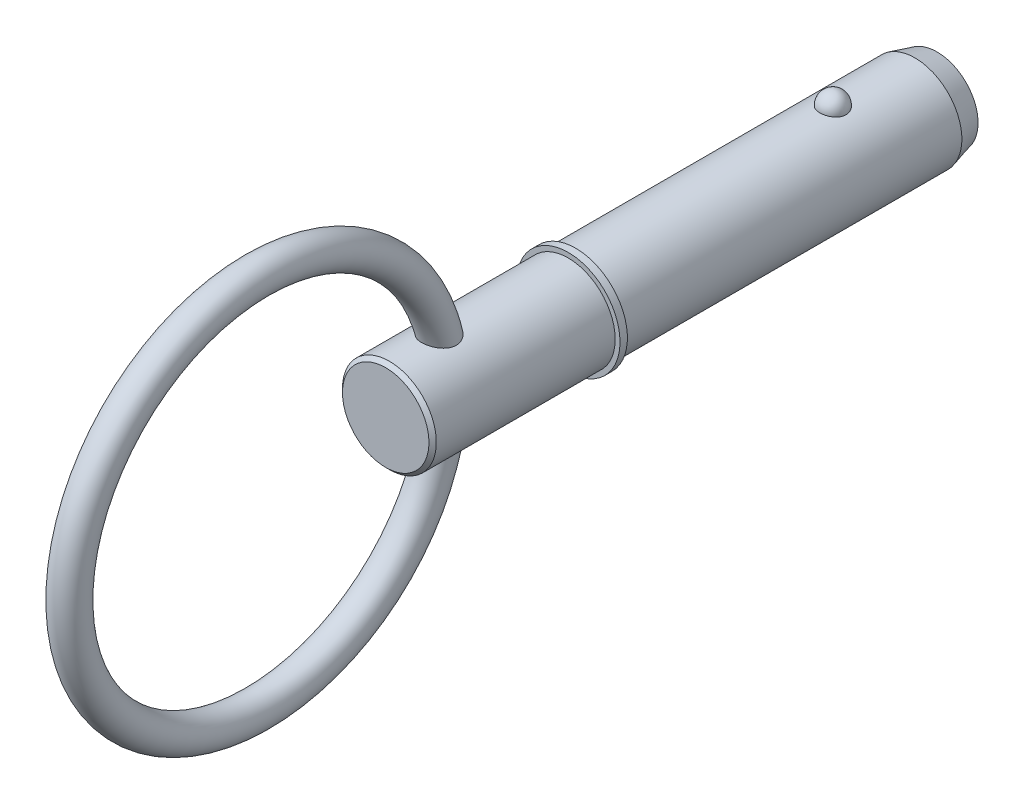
ISO-10303-21;
HEADER;
FILE_DESCRIPTION(('STEP AP214'),'2;1');
FILE_NAME('part.step','',(''),(''),'','','');
FILE_SCHEMA(('AUTOMOTIVE_DESIGN { 1 0 10303 214 1 1 1 1 }'));
ENDSEC;
DATA;
#1=APPLICATION_CONTEXT('core data for automotive mechanical design processes');
#2=APPLICATION_PROTOCOL_DEFINITION('international standard','automotive_design',2000,#1);
#3=PRODUCT_CONTEXT('',#1,'mechanical');
#4=PRODUCT('Part','Part','',(#3));
#5=PRODUCT_RELATED_PRODUCT_CATEGORY('part','',(#4));
#6=PRODUCT_DEFINITION_FORMATION('','',#4);
#7=PRODUCT_DEFINITION_CONTEXT('part definition',#1,'design');
#8=PRODUCT_DEFINITION('design','',#6,#7);
#9=PRODUCT_DEFINITION_SHAPE('','',#8);
#10=(LENGTH_UNIT() NAMED_UNIT(*) SI_UNIT(.MILLI.,.METRE.));
#11=(NAMED_UNIT(*) PLANE_ANGLE_UNIT() SI_UNIT($,.RADIAN.));
#12=(NAMED_UNIT(*) SI_UNIT($,.STERADIAN.) SOLID_ANGLE_UNIT());
#13=UNCERTAINTY_MEASURE_WITH_UNIT(LENGTH_MEASURE(1.E-05),#10,'distance_accuracy_value','');
#14=(GEOMETRIC_REPRESENTATION_CONTEXT(3) GLOBAL_UNCERTAINTY_ASSIGNED_CONTEXT((#13)) GLOBAL_UNIT_ASSIGNED_CONTEXT((#10,
#11,#12)) REPRESENTATION_CONTEXT('',''));
#15=CARTESIAN_POINT('',(0.,0.,0.));
#16=DIRECTION('',(0.,0.,1.));
#17=DIRECTION('',(1.,0.,0.));
#18=AXIS2_PLACEMENT_3D('',#15,#16,#17);
#19=CARTESIAN_POINT('',(0.,0.,33.02));
#20=DIRECTION('',(0.,0.,-1.));
#21=DIRECTION('',(-1.,0.,0.));
#22=AXIS2_PLACEMENT_3D('',#19,#20,#21);
#23=CYLINDRICAL_SURFACE('',#22,6.35);
#24=CARTESIAN_POINT('',(1.76243001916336,6.10051968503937,-1.78));
#25=CARTESIAN_POINT('',(1.76242835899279,6.10052111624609,-1.68050311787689));
#26=CARTESIAN_POINT('',(1.75431593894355,6.1028816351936,-1.58098521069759));
#27=CARTESIAN_POINT('',(1.72206027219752,6.11206037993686,-1.38476972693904));
#28=CARTESIAN_POINT('',(1.69791106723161,6.11888026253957,-1.28807321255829));
#29=CARTESIAN_POINT('',(1.63419596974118,6.13620287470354,-1.10029899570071));
#30=CARTESIAN_POINT('',(1.59463684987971,6.14670398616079,-1.00921884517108));
#31=CARTESIAN_POINT('',(1.50108569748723,6.17021534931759,-0.835161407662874));
#32=CARTESIAN_POINT('',(1.44709398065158,6.18322554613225,-0.752183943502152));
#33=CARTESIAN_POINT('',(1.3257243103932,6.21038081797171,-0.596209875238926));
#34=CARTESIAN_POINT('',(1.2582815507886,6.22453118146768,-0.523264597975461));
#35=CARTESIAN_POINT('',(1.11191624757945,6.25233390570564,-0.389855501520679));
#36=CARTESIAN_POINT('',(1.03299369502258,6.26598626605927,-0.329391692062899));
#37=CARTESIAN_POINT('',(0.866022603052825,6.29123226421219,-0.222793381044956));
#38=CARTESIAN_POINT('',(0.778000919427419,6.30283170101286,-0.176618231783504));
#39=CARTESIAN_POINT('',(0.59510847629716,6.32272058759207,-0.0996905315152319));
#40=CARTESIAN_POINT('',(0.500238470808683,6.33101040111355,-0.0689362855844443));
#41=CARTESIAN_POINT('',(0.308164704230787,6.34323464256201,-0.0241595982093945));
#42=CARTESIAN_POINT('',(0.211033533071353,6.34724467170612,-0.00984637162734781));
#43=CARTESIAN_POINT('',(0.0156629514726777,6.3507318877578,0.00262058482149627));
#44=CARTESIAN_POINT('',(-0.0825763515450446,6.35020951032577,0.000775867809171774));
#45=CARTESIAN_POINT('',(-0.275890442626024,6.34473055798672,-0.018872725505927));
#46=CARTESIAN_POINT('',(-0.370990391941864,6.3398374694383,-0.0364481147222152));
#47=CARTESIAN_POINT('',(-0.556805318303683,6.32622723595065,-0.0867447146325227));
#48=CARTESIAN_POINT('',(-0.647520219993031,6.31751002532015,-0.119466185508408));
#49=CARTESIAN_POINT('',(-0.822606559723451,6.29711353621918,-0.199386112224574));
#50=CARTESIAN_POINT('',(-0.906938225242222,6.28541739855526,-0.246667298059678));
#51=CARTESIAN_POINT('',(-1.06646479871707,6.26032612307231,-0.354365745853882));
#52=CARTESIAN_POINT('',(-1.14165877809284,6.24693081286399,-0.414784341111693));
#53=CARTESIAN_POINT('',(-1.2823514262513,6.21959142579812,-0.548435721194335));
#54=CARTESIAN_POINT('',(-1.34763761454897,6.2056417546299,-0.621891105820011));
#55=CARTESIAN_POINT('',(-1.4651153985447,6.17896241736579,-0.778815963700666));
#56=CARTESIAN_POINT('',(-1.51730606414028,6.16623283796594,-0.862286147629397));
#57=CARTESIAN_POINT('',(-1.60782211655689,6.14325839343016,-1.0379915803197));
#58=CARTESIAN_POINT('',(-1.64598111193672,6.13304379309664,-1.13031660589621));
#59=CARTESIAN_POINT('',(-1.70661885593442,6.11644899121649,-1.32030667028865));
#60=CARTESIAN_POINT('',(-1.72909805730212,6.11006867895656,-1.41797155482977));
#61=CARTESIAN_POINT('',(-1.75775019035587,6.1018881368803,-1.61543246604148));
#62=CARTESIAN_POINT('',(-1.76399136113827,6.10006874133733,-1.71521779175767));
#63=CARTESIAN_POINT('',(-1.76020715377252,6.10116172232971,-1.91445126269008));
#64=CARTESIAN_POINT('',(-1.75018221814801,6.10407397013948,-2.01389941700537));
#65=CARTESIAN_POINT('',(-1.71421005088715,6.11427232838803,-2.20912106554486));
#66=CARTESIAN_POINT('',(-1.68834262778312,6.12153651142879,-2.30491043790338));
#67=CARTESIAN_POINT('',(-1.62139543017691,6.1396067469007,-2.49066180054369));
#68=CARTESIAN_POINT('',(-1.5803150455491,6.15041294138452,-2.58062355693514));
#69=CARTESIAN_POINT('',(-1.48369112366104,6.17443456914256,-2.75271428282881));
#70=CARTESIAN_POINT('',(-1.42806998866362,6.18766281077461,-2.83479789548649));
#71=CARTESIAN_POINT('',(-1.30386620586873,6.21501934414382,-2.98832532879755));
#72=CARTESIAN_POINT('',(-1.23528306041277,6.22914767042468,-3.05976874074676));
#73=CARTESIAN_POINT('',(-1.08663999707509,6.25679135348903,-3.19029656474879));
#74=CARTESIAN_POINT('',(-1.00653826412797,6.27030422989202,-3.24933392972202));
#75=CARTESIAN_POINT('',(-0.837212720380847,6.29514770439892,-3.35304657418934));
#76=CARTESIAN_POINT('',(-0.747989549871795,6.30647845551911,-3.39772286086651));
#77=CARTESIAN_POINT('',(-0.564098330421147,6.32556124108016,-3.47096393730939));
#78=CARTESIAN_POINT('',(-0.469512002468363,6.33335611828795,-3.49972259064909));
#79=CARTESIAN_POINT('',(-0.27663389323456,6.34470628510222,-3.54113722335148));
#80=CARTESIAN_POINT('',(-0.17834256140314,6.34826208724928,-3.55379514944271));
#81=CARTESIAN_POINT('',(0.0171660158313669,6.35071525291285,-3.56255473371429));
#82=CARTESIAN_POINT('',(0.114368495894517,6.34969931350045,-3.55896450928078));
#83=CARTESIAN_POINT('',(0.306746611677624,6.34331695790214,-3.53603383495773));
#84=CARTESIAN_POINT('',(0.401922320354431,6.33795069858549,-3.51669395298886));
#85=CARTESIAN_POINT('',(0.587203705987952,6.32347219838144,-3.4629173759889));
#86=CARTESIAN_POINT('',(0.677327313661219,6.31437430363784,-3.42853846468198));
#87=CARTESIAN_POINT('',(0.850462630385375,6.29339543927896,-3.34564128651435));
#88=CARTESIAN_POINT('',(0.933473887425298,6.2815142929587,-3.29712212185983));
#89=CARTESIAN_POINT('',(1.09144542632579,6.25601750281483,-3.18638742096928));
#90=CARTESIAN_POINT('',(1.16626195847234,6.24237795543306,-3.12397237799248));
#91=CARTESIAN_POINT('',(1.304448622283,6.21497285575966,-2.98755865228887));
#92=CARTESIAN_POINT('',(1.36781676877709,6.20120728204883,-2.91355796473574));
#93=CARTESIAN_POINT('',(1.48252779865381,6.17479923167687,-2.75456133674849));
#94=CARTESIAN_POINT('',(1.53364167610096,6.16218052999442,-2.66939613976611));
#95=CARTESIAN_POINT('',(1.62109397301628,6.13975602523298,-2.49147502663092));
#96=CARTESIAN_POINT('',(1.657437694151,6.12994921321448,-2.39872184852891));
#97=CARTESIAN_POINT('',(1.71127844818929,6.11512175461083,-2.21887622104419));
#98=CARTESIAN_POINT('',(1.73042646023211,6.10968903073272,-2.13230770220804));
#99=CARTESIAN_POINT('',(1.75600284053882,6.10238739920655,-1.95716498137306));
#100=CARTESIAN_POINT('',(1.76243149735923,6.10051841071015,-1.86859082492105));
#101=CARTESIAN_POINT('',(1.76243001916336,6.10051968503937,-1.78));
#102=B_SPLINE_CURVE_WITH_KNOTS('',3,(#24,#25,#26,#27,#28,#29,#30,#31,#32,#33,#34,#35,#36,#37,
#38,#39,#40,#41,#42,#43,#44,#45,#46,#47,#48,#49,#50,#51,#52,#53,#54,#55,#56,#57,#58,#59,#60,#61,
#62,#63,#64,#65,#66,#67,#68,#69,#70,#71,#72,#73,#74,#75,#76,#77,#78,#79,#80,#81,#82,#83,#84,#85,
#86,#87,#88,#89,#90,#91,#92,#93,#94,#95,#96,#97,#98,#99,#100,#101),.UNSPECIFIED.,.T.,.F.,(4,2,2,
2,2,2,2,2,2,2,2,2,2,2,2,2,2,2,2,2,2,2,2,2,2,2,2,2,2,2,2,2,2,2,2,2,2,2,4),(0.,0.298172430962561,
0.596455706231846,0.894608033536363,1.19275383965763,1.49237238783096,1.79199116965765,
2.09074960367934,2.38947519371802,2.68283180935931,2.97616022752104,3.26529599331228,
3.5544367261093,3.84525169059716,4.13609618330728,4.43249276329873,4.72891038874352,
5.02873757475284,5.32855610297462,5.62711261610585,5.92566100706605,6.22271765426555,
6.519786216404,6.81847366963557,7.11717259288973,7.41698459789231,7.71677557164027,
8.01283014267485,8.30884891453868,8.59927798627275,8.88969658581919,9.17900899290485,
9.46833977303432,9.76212836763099,10.0559678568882,10.3549321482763,10.6537890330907,
10.9192841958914,11.1847733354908),.UNSPECIFIED.);
#103=CARTESIAN_POINT('',(1.76243001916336,6.10051968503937,-1.78));
#104=VERTEX_POINT('',#103);
#105=EDGE_CURVE('E103',#104,#104,#102,.T.);
#106=ORIENTED_EDGE('',*,*,#105,.T.);
#107=EDGE_LOOP('',(#106));
#108=FACE_BOUND('',#107,.T.);
#109=CARTESIAN_POINT('',(0.,0.,-12.88));
#110=DIRECTION('',(0.,0.,-1.));
#111=DIRECTION('',(-1.,0.,0.));
#112=AXIS2_PLACEMENT_3D('',#109,#110,#111);
#113=CIRCLE('',#112,6.35);
#114=CARTESIAN_POINT('',(-6.35,0.,-12.88));
#115=VERTEX_POINT('',#114);
#116=EDGE_CURVE('E110',#115,#115,#113,.F.);
#117=ORIENTED_EDGE('',*,*,#116,.T.);
#118=EDGE_LOOP('',(#117));
#119=FACE_BOUND('',#118,.T.);
#120=CARTESIAN_POINT('',(0.,0.,33.02));
#121=DIRECTION('',(0.,0.,1.));
#122=DIRECTION('',(1.,0.,0.));
#123=AXIS2_PLACEMENT_3D('',#120,#121,#122);
#124=CIRCLE('',#123,6.35);
#125=CARTESIAN_POINT('',(6.35,0.,33.02));
#126=VERTEX_POINT('',#125);
#127=EDGE_CURVE('E108',#126,#126,#124,.T.);
#128=ORIENTED_EDGE('',*,*,#127,.F.);
#129=EDGE_LOOP('',(#128));
#130=FACE_BOUND('',#129,.T.);
#131=ADVANCED_FACE('F39',(#108,#119,#130),#23,.T.);
#132=CARTESIAN_POINT('',(0.,0.,-15.88));
#133=DIRECTION('',(0.,0.,-1.));
#134=DIRECTION('',(-1.,0.,0.));
#135=AXIS2_PLACEMENT_3D('',#132,#133,#134);
#136=PLANE('',#135);
#137=CARTESIAN_POINT('',(0.,0.,-15.88));
#138=DIRECTION('',(0.,0.,-1.));
#139=DIRECTION('',(-1.,0.,0.));
#140=AXIS2_PLACEMENT_3D('',#137,#138,#139);
#141=CIRCLE('',#140,5.54615242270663);
#142=CARTESIAN_POINT('',(-5.54615242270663,0.,-15.88));
#143=VERTEX_POINT('',#142);
#144=EDGE_CURVE('E140',#143,#143,#141,.T.);
#145=ORIENTED_EDGE('',*,*,#144,.T.);
#146=EDGE_LOOP('',(#145));
#147=FACE_BOUND('',#146,.T.);
#148=ADVANCED_FACE('F89',(#147),#136,.T.);
#149=CARTESIAN_POINT('',(0.,0.,-15.88));
#150=DIRECTION('',(0.,0.,1.));
#151=DIRECTION('',(1.,0.,0.));
#152=AXIS2_PLACEMENT_3D('',#149,#150,#151);
#153=CONICAL_SURFACE('',#152,5.54615242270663,0.261799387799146);
#154=ORIENTED_EDGE('',*,*,#116,.F.);
#155=EDGE_LOOP('',(#154));
#156=FACE_BOUND('',#155,.T.);
#157=ORIENTED_EDGE('',*,*,#144,.F.);
#158=EDGE_LOOP('',(#157));
#159=FACE_BOUND('',#158,.T.);
#160=ADVANCED_FACE('F95',(#156,#159),#153,.T.);
#161=CARTESIAN_POINT('',(0.,6.35,-1.78));
#162=DIRECTION('',(0.,1.,0.));
#163=DIRECTION('',(0.,0.,1.));
#164=AXIS2_PLACEMENT_3D('',#161,#162,#163);
#165=SPHERICAL_SURFACE('',#164,1.78);
#166=ORIENTED_EDGE('',*,*,#105,.F.);
#167=EDGE_LOOP('',(#166));
#168=FACE_BOUND('',#167,.T.);
#169=ADVANCED_FACE('F113',(#168),#165,.T.);
#170=CARTESIAN_POINT('',(0.,0.,33.02));
#171=DIRECTION('',(0.,0.,-1.));
#172=DIRECTION('',(-1.,0.,0.));
#173=AXIS2_PLACEMENT_3D('',#170,#171,#172);
#174=PLANE('',#173);
#175=ORIENTED_EDGE('',*,*,#127,.T.);
#176=EDGE_LOOP('',(#175));
#177=FACE_BOUND('',#176,.T.);
#178=CARTESIAN_POINT('',(0.,0.,33.02));
#179=DIRECTION('',(0.,0.,-1.));
#180=DIRECTION('',(-1.,0.,0.));
#181=AXIS2_PLACEMENT_3D('',#178,#179,#180);
#182=CIRCLE('',#181,7.);
#183=CARTESIAN_POINT('',(-7.,0.,33.02));
#184=VERTEX_POINT('',#183);
#185=EDGE_CURVE('E109',#184,#184,#182,.T.);
#186=ORIENTED_EDGE('',*,*,#185,.T.);
#187=EDGE_LOOP('',(#186));
#188=FACE_BOUND('',#187,.T.);
#189=ADVANCED_FACE('F117',(#177,#188),#174,.T.);
#190=CARTESIAN_POINT('',(0.,0.,33.7287874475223));
#191=DIRECTION('',(0.,0.,-1.));
#192=DIRECTION('',(-1.,0.,0.));
#193=AXIS2_PLACEMENT_3D('',#190,#191,#192);
#194=CYLINDRICAL_SURFACE('',#193,7.);
#195=CARTESIAN_POINT('',(0.,0.,34.02));
#196=DIRECTION('',(0.,0.,-1.));
#197=DIRECTION('',(-1.,0.,0.));
#198=AXIS2_PLACEMENT_3D('',#195,#196,#197);
#199=CIRCLE('',#198,7.);
#200=CARTESIAN_POINT('',(-7.,0.,34.02));
#201=VERTEX_POINT('',#200);
#202=EDGE_CURVE('E134',#201,#201,#199,.T.);
#203=ORIENTED_EDGE('',*,*,#202,.T.);
#204=EDGE_LOOP('',(#203));
#205=FACE_BOUND('',#204,.T.);
#206=ORIENTED_EDGE('',*,*,#185,.F.);
#207=EDGE_LOOP('',(#206));
#208=FACE_BOUND('',#207,.T.);
#209=ADVANCED_FACE('F121',(#205,#208),#194,.T.);
#210=CARTESIAN_POINT('',(0.,7.,34.02));
#211=DIRECTION('',(0.,0.,1.));
#212=DIRECTION('',(1.,0.,0.));
#213=AXIS2_PLACEMENT_3D('',#210,#211,#212);
#214=PLANE('',#213);
#215=CARTESIAN_POINT('',(0.,0.,34.02));
#216=DIRECTION('',(0.,0.,1.));
#217=DIRECTION('',(1.,0.,0.));
#218=AXIS2_PLACEMENT_3D('',#215,#216,#217);
#219=CIRCLE('',#218,6.35);
#220=CARTESIAN_POINT('',(6.35,0.,34.02));
#221=VERTEX_POINT('',#220);
#222=EDGE_CURVE('E112',#221,#221,#219,.T.);
#223=ORIENTED_EDGE('',*,*,#222,.F.);
#224=EDGE_LOOP('',(#223));
#225=FACE_BOUND('',#224,.T.);
#226=ORIENTED_EDGE('',*,*,#202,.F.);
#227=EDGE_LOOP('',(#226));
#228=FACE_BOUND('',#227,.T.);
#229=ADVANCED_FACE('F86',(#225,#228),#214,.T.);
#230=CARTESIAN_POINT('',(0.,0.,58.72));
#231=DIRECTION('',(0.,0.,-1.));
#232=DIRECTION('',(-1.,0.,0.));
#233=AXIS2_PLACEMENT_3D('',#230,#231,#232);
#234=CYLINDRICAL_SURFACE('',#233,6.35);
#235=CARTESIAN_POINT('',(-1.08120660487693,-6.25727514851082,49.4715811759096));
#236=CARTESIAN_POINT('',(-0.970724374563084,-6.27636409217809,49.4138798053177));
#237=CARTESIAN_POINT('',(-0.855136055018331,-6.29329984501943,49.3652195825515));
#238=CARTESIAN_POINT('',(-0.6169586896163,-6.32109419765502,49.2870559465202));
#239=CARTESIAN_POINT('',(-0.494369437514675,-6.3319526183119,49.2575530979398));
#240=CARTESIAN_POINT('',(-0.245606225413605,-6.34647141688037,49.2183673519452));
#241=CARTESIAN_POINT('',(-0.119431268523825,-6.35012977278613,49.2086900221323));
#242=CARTESIAN_POINT('',(0.132849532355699,-6.34986313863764,49.2094002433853));
#243=CARTESIAN_POINT('',(0.258955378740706,-6.34593843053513,49.2197870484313));
#244=CARTESIAN_POINT('',(0.506912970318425,-6.33094785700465,49.2602854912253));
#245=CARTESIAN_POINT('',(0.628781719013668,-6.31991516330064,49.2903055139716));
#246=CARTESIAN_POINT('',(0.865486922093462,-6.29187143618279,49.3693088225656));
#247=CARTESIAN_POINT('',(0.98032275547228,-6.27485987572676,49.418293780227));
#248=CARTESIAN_POINT('',(1.20050616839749,-6.23649440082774,49.5345408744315));
#249=CARTESIAN_POINT('',(1.30578867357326,-6.21511352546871,49.6019174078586));
#250=CARTESIAN_POINT('',(1.50311440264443,-6.17036440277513,49.7533596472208));
#251=CARTESIAN_POINT('',(1.59515714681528,-6.14699608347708,49.8374259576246));
#252=CARTESIAN_POINT('',(1.76326863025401,-6.10090072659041,50.0202474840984));
#253=CARTESIAN_POINT('',(1.83935482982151,-6.07817301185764,50.1189864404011));
#254=CARTESIAN_POINT('',(1.97338559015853,-6.03599268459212,50.328703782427));
#255=CARTESIAN_POINT('',(2.03133638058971,-6.01653894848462,50.4396779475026));
#256=CARTESIAN_POINT('',(2.1259120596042,-5.98376466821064,50.667018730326));
#257=CARTESIAN_POINT('',(2.16315310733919,-5.97026970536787,50.7831040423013));
#258=CARTESIAN_POINT('',(2.21830650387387,-5.94999923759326,51.0203187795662));
#259=CARTESIAN_POINT('',(2.2362211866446,-5.94322292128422,51.1414475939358));
#260=CARTESIAN_POINT('',(2.25273772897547,-5.93698111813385,51.3832812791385));
#261=CARTESIAN_POINT('',(2.25163224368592,-5.93740484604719,51.5039640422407));
#262=CARTESIAN_POINT('',(2.23167546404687,-5.94493297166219,51.7436203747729));
#263=CARTESIAN_POINT('',(2.21281883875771,-5.9520393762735,51.8625934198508));
#264=CARTESIAN_POINT('',(2.15679576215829,-5.97257680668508,52.103836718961));
#265=CARTESIAN_POINT('',(2.11851138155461,-5.98639144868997,52.2258128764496));
#266=CARTESIAN_POINT('',(2.02470263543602,-6.01876484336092,52.4622848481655));
#267=CARTESIAN_POINT('',(1.96916879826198,-6.03732620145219,52.5767765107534));
#268=CARTESIAN_POINT('',(1.8352662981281,-6.07945247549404,52.8079958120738));
#269=CARTESIAN_POINT('',(1.75507038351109,-6.10334207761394,52.9236110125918));
#270=CARTESIAN_POINT('',(1.57657889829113,-6.1518655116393,53.1398949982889));
#271=CARTESIAN_POINT('',(1.47827192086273,-6.17649980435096,53.2405542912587));
#272=CARTESIAN_POINT('',(1.26306696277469,-6.22410762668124,53.4250235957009));
#273=CARTESIAN_POINT('',(1.14585214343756,-6.24704086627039,53.5084783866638));
#274=CARTESIAN_POINT('',(0.896825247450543,-6.28760987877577,53.651400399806));
#275=CARTESIAN_POINT('',(0.765036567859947,-6.30525397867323,53.7109053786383));
#276=CARTESIAN_POINT('',(0.509454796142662,-6.330648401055,53.7952631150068));
#277=CARTESIAN_POINT('',(0.386964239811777,-6.33940909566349,53.8236959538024));
#278=CARTESIAN_POINT('',(0.200813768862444,-6.3471308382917,53.8486800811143));
#279=CARTESIAN_POINT('',(0.138353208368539,-6.34880140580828,53.854063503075));
#280=CARTESIAN_POINT('',(0.0131841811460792,-6.35029448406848,53.8588738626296));
#281=CARTESIAN_POINT('',(-0.0495242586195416,-6.35011719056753,53.8583014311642));
#282=CARTESIAN_POINT('',(-0.219860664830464,-6.34710452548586,53.8485979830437));
#283=CARTESIAN_POINT('',(-0.327176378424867,-6.34243953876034,53.8335767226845));
#284=CARTESIAN_POINT('',(-0.537619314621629,-6.32808248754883,53.786673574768));
#285=CARTESIAN_POINT('',(-0.640746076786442,-6.31838987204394,53.7547898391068));
#286=CARTESIAN_POINT('',(-0.841795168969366,-6.29478075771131,53.6753379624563));
#287=CARTESIAN_POINT('',(-0.939631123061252,-6.28081033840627,53.62756888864));
#288=CARTESIAN_POINT('',(-1.12690564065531,-6.2499288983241,53.5185138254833));
#289=CARTESIAN_POINT('',(-1.21634109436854,-6.2330167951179,53.457222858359));
#290=CARTESIAN_POINT('',(-1.3971303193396,-6.19517308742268,53.3140397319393));
#291=CARTESIAN_POINT('',(-1.48711596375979,-6.17400700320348,53.2304839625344));
#292=CARTESIAN_POINT('',(-1.65373642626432,-6.13148145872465,53.050996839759));
#293=CARTESIAN_POINT('',(-1.73036130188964,-6.11012186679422,52.9550563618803));
#294=CARTESIAN_POINT('',(-1.87908981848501,-6.06616529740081,52.7386208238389));
#295=CARTESIAN_POINT('',(-1.94902044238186,-6.04382072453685,52.6165721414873));
#296=CARTESIAN_POINT('',(-2.06849605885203,-6.00398244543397,52.3620700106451));
#297=CARTESIAN_POINT('',(-2.11803457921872,-5.98649027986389,52.2296132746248));
#298=CARTESIAN_POINT('',(-2.19551930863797,-5.95851933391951,51.9545936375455));
#299=CARTESIAN_POINT('',(-2.22297667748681,-5.94819998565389,51.8118743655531));
#300=CARTESIAN_POINT('',(-2.25222139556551,-5.93719450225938,51.5234800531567));
#301=CARTESIAN_POINT('',(-2.25403508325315,-5.93649848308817,51.3778081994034));
#302=CARTESIAN_POINT('',(-2.23178480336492,-5.94489150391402,51.1038044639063));
#303=CARTESIAN_POINT('',(-2.21035650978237,-5.95298402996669,50.9752268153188));
#304=CARTESIAN_POINT('',(-2.14565882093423,-5.97660650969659,50.7244089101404));
#305=CARTESIAN_POINT('',(-2.10239634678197,-5.99213410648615,50.6021666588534));
#306=CARTESIAN_POINT('',(-1.99913159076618,-6.02732890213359,50.3767478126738));
#307=CARTESIAN_POINT('',(-1.94060271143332,-6.04660536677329,50.2728298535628));
#308=CARTESIAN_POINT('',(-1.80736340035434,-6.0877569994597,50.076534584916));
#309=CARTESIAN_POINT('',(-1.73265259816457,-6.10963222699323,49.9841575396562));
#310=CARTESIAN_POINT('',(-1.56865095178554,-6.15378470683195,49.8126034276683));
#311=CARTESIAN_POINT('',(-1.47928749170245,-6.17606344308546,49.7334962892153));
#312=CARTESIAN_POINT('',(-1.28858731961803,-6.21864788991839,49.5906753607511));
#313=CARTESIAN_POINT('',(-1.18724893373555,-6.23895332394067,49.5269637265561));
#314=CARTESIAN_POINT('',(-1.08120660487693,-6.25727514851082,49.4715811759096));
#315=B_SPLINE_CURVE_WITH_KNOTS('',3,(#235,#236,#237,#238,#239,#240,#241,#242,#243,#244,#245,
#246,#247,#248,#249,#250,#251,#252,#253,#254,#255,#256,#257,#258,#259,#260,#261,#262,#263,#264,
#265,#266,#267,#268,#269,#270,#271,#272,#273,#274,#275,#276,#277,#278,#279,#280,#281,#282,#283,
#284,#285,#286,#287,#288,#289,#290,#291,#292,#293,#294,#295,#296,#297,#298,#299,#300,#301,#302,
#303,#304,#305,#306,#307,#308,#309,#310,#311,#312,#313,#314),.UNSPECIFIED.,.T.,.F.,(4,2,2,2,2,2,
2,2,2,2,2,2,2,2,2,2,2,2,2,2,2,2,2,2,2,2,2,2,2,2,2,2,2,2,2,2,2,2,2,4),(0.,0.37786171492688,
0.755734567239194,1.13371352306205,1.51167842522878,1.88789208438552,2.26413891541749,
2.64278156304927,3.02143792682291,3.3996777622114,3.77778752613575,4.14394628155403,
4.51006081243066,4.87054720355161,5.23114188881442,5.61534494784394,5.99975934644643,
6.42600522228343,6.85252048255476,7.28711365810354,7.721018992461,8.0966613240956,
8.28452949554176,8.47237776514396,8.79607953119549,9.11981678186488,9.44781545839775,
9.77593508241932,10.1483085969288,10.5209580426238,10.9463240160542,11.3718248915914,
11.8065046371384,12.2407378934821,12.6304236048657,13.0199858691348,13.3807583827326,
13.7415391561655,14.104165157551,14.4668419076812),.UNSPECIFIED.);
#316=CARTESIAN_POINT('',(-1.08120660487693,-6.25727514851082,49.4715811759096));
#317=VERTEX_POINT('',#316);
#318=EDGE_CURVE('E10',#317,#317,#315,.T.);
#319=ORIENTED_EDGE('',*,*,#318,.F.);
#320=EDGE_LOOP('',(#319));
#321=FACE_BOUND('',#320,.T.);
#322=CARTESIAN_POINT('',(-1.08120660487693,6.25727514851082,49.4715811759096));
#323=CARTESIAN_POINT('',(-1.19093168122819,6.23831652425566,49.528887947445));
#324=CARTESIAN_POINT('',(-1.29562751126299,6.21723224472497,49.5951167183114));
#325=CARTESIAN_POINT('',(-1.49211272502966,6.17302620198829,49.744020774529));
#326=CARTESIAN_POINT('',(-1.58390200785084,6.14990442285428,49.8266961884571));
#327=CARTESIAN_POINT('',(-1.75209695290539,6.10411985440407,50.0067778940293));
#328=CARTESIAN_POINT('',(-1.82848346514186,6.08145766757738,50.1042022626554));
#329=CARTESIAN_POINT('',(-1.96346259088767,6.0392331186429,50.3112733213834));
#330=CARTESIAN_POINT('',(-2.02206050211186,6.01966983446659,50.4209163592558));
#331=CARTESIAN_POINT('',(-2.11860444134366,5.9863659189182,50.6465649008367));
#332=CARTESIAN_POINT('',(-2.15701637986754,5.97249571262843,50.7623519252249));
#333=CARTESIAN_POINT('',(-2.21449304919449,5.95142584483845,50.9991911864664));
#334=CARTESIAN_POINT('',(-2.23356015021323,5.94422536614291,51.1202427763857));
#335=CARTESIAN_POINT('',(-2.25228141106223,5.93715610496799,51.3619445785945));
#336=CARTESIAN_POINT('',(-2.25225786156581,5.93716560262,51.4825670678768));
#337=CARTESIAN_POINT('',(-2.2344206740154,5.94389982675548,51.7222777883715));
#338=CARTESIAN_POINT('',(-2.21660184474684,5.95062651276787,51.8413655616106));
#339=CARTESIAN_POINT('',(-2.16272689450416,5.97042554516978,52.0827056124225));
#340=CARTESIAN_POINT('',(-2.12559286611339,5.98387086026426,52.2046848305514));
#341=CARTESIAN_POINT('',(-2.03409944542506,6.0155857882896,52.441342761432));
#342=CARTESIAN_POINT('',(-1.97973080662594,6.03385799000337,52.5560175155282));
#343=CARTESIAN_POINT('',(-1.84828023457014,6.07549301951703,52.7878654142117));
#344=CARTESIAN_POINT('',(-1.76936622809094,6.09919386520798,52.9039437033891));
#345=CARTESIAN_POINT('',(-1.59344783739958,6.14749881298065,53.1214208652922));
#346=CARTESIAN_POINT('',(-1.49643151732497,6.17210350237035,53.2228099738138));
#347=CARTESIAN_POINT('',(-1.28333318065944,6.21994692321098,53.4095083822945));
#348=CARTESIAN_POINT('',(-1.1668572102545,6.24314005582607,53.4943845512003));
#349=CARTESIAN_POINT('',(-0.919062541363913,6.2843871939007,53.6403440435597));
#350=CARTESIAN_POINT('',(-0.787766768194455,6.30244898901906,53.7014634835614));
#351=CARTESIAN_POINT('',(-0.532335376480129,6.32876911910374,53.7891112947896));
#352=CARTESIAN_POINT('',(-0.409516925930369,6.33800211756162,53.8191235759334));
#353=CARTESIAN_POINT('',(-0.222636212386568,6.34640533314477,53.8463386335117));
#354=CARTESIAN_POINT('',(-0.159893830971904,6.34829860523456,53.8524428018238));
#355=CARTESIAN_POINT('',(-0.034087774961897,6.35021985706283,53.8586341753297));
#356=CARTESIAN_POINT('',(0.0289758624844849,6.35024804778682,53.8587220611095));
#357=CARTESIAN_POINT('',(0.200008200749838,6.34776620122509,53.850732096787));
#358=CARTESIAN_POINT('',(0.307730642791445,6.34342046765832,53.8367500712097));
#359=CARTESIAN_POINT('',(0.519134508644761,6.32963338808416,53.7917653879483));
#360=CARTESIAN_POINT('',(0.622815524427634,6.3201915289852,53.7607610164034));
#361=CARTESIAN_POINT('',(0.824580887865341,6.2970603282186,53.6830869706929));
#362=CARTESIAN_POINT('',(0.92261147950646,6.28333629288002,53.6362890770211));
#363=CARTESIAN_POINT('',(1.11039970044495,6.2528858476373,53.5291226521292));
#364=CARTESIAN_POINT('',(1.20015435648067,6.23615836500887,53.4687492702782));
#365=CARTESIAN_POINT('',(1.38155818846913,6.19866747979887,53.3276024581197));
#366=CARTESIAN_POINT('',(1.47187645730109,6.17766310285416,53.2451847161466));
#367=CARTESIAN_POINT('',(1.63933626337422,6.13535258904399,53.0679469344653));
#368=CARTESIAN_POINT('',(1.71646809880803,6.11404624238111,52.9731178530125));
#369=CARTESIAN_POINT('',(1.86660460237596,6.07002946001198,52.758851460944));
#370=CARTESIAN_POINT('',(1.93743710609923,6.04755477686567,52.6378347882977));
#371=CARTESIAN_POINT('',(2.05894300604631,6.00727604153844,52.3852808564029));
#372=CARTESIAN_POINT('',(2.1096091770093,5.98947366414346,52.253739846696));
#373=CARTESIAN_POINT('',(2.18982014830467,5.96062717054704,51.9797589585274));
#374=CARTESIAN_POINT('',(2.21877575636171,5.94977267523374,51.8371236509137));
#375=CARTESIAN_POINT('',(2.25104759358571,5.93764416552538,51.5485958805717));
#376=CARTESIAN_POINT('',(2.25438985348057,5.93636042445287,51.4027068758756));
#377=CARTESIAN_POINT('',(2.23498011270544,5.94368858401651,51.1277311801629));
#378=CARTESIAN_POINT('',(2.21482640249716,5.95131530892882,50.9984341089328));
#379=CARTESIAN_POINT('',(2.15248760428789,5.97414352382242,50.7459695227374));
#380=CARTESIAN_POINT('',(2.11031020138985,5.98934237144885,50.6227998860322));
#381=CARTESIAN_POINT('',(2.00904610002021,6.02402214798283,50.3957832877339));
#382=CARTESIAN_POINT('',(1.95150192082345,6.04308594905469,50.2911789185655));
#383=CARTESIAN_POINT('',(1.82009972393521,6.08395083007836,50.0933823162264));
#384=CARTESIAN_POINT('',(1.74624088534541,6.10575204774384,50.0001906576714));
#385=CARTESIAN_POINT('',(1.58309476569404,6.15008431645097,49.8261646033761));
#386=CARTESIAN_POINT('',(1.49360904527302,6.17262128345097,49.7455180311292));
#387=CARTESIAN_POINT('',(1.30231515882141,6.21579297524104,49.5998366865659));
#388=CARTESIAN_POINT('',(1.20050521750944,6.23642742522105,49.5348041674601));
#389=CARTESIAN_POINT('',(0.983786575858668,6.27432316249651,49.4198596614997));
#390=CARTESIAN_POINT('',(0.868563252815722,6.29145558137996,49.3704972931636));
#391=CARTESIAN_POINT('',(0.630994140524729,6.31970327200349,49.2908857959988));
#392=CARTESIAN_POINT('',(0.508648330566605,6.33081852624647,49.2606367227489));
#393=CARTESIAN_POINT('',(0.259933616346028,6.34590352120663,49.2198795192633));
#394=CARTESIAN_POINT('',(0.133554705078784,6.34985380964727,49.2094251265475));
#395=CARTESIAN_POINT('',(-0.119270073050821,6.35013815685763,49.2086676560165));
#396=CARTESIAN_POINT('',(-0.245715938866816,6.34647233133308,49.2183642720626));
#397=CARTESIAN_POINT('',(-0.494670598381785,6.33192772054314,49.2576209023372));
#398=CARTESIAN_POINT('',(-0.617189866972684,6.3210701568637,49.2871224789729));
#399=CARTESIAN_POINT('',(-0.855240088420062,6.29328476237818,49.3652630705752));
#400=CARTESIAN_POINT('',(-0.97077065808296,6.27635659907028,49.4139031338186));
#401=CARTESIAN_POINT('',(-1.08120660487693,6.25727514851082,49.4715811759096));
#402=B_SPLINE_CURVE_WITH_KNOTS('',3,(#322,#323,#324,#325,#326,#327,#328,#329,#330,#331,#332,
#333,#334,#335,#336,#337,#338,#339,#340,#341,#342,#343,#344,#345,#346,#347,#348,#349,#350,#351,
#352,#353,#354,#355,#356,#357,#358,#359,#360,#361,#362,#363,#364,#365,#366,#367,#368,#369,#370,
#371,#372,#373,#374,#375,#376,#377,#378,#379,#380,#381,#382,#383,#384,#385,#386,#387,#388,#389,
#390,#391,#392,#393,#394,#395,#396,#397,#398,#399,#400,#401),.UNSPECIFIED.,.T.,.F.,(4,2,2,2,2,2,
2,2,2,2,2,2,2,2,2,2,2,2,2,2,2,2,2,2,2,2,2,2,2,2,2,2,2,2,2,2,2,2,2,4),(0.,0.375258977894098,
0.750520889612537,1.12624651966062,1.50186014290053,1.86837438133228,2.23484370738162,
2.59512638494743,2.95551419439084,3.33859924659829,3.7218901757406,4.14704029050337,
4.5724717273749,5.00788576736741,5.44263524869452,5.82040093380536,6.00932292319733,
6.19822354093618,6.5226607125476,6.84713055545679,7.17430063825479,7.50158780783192,
7.8723327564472,8.24334931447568,8.66748794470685,9.09177840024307,9.52720369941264,
9.96218641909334,10.3532895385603,10.7442562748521,11.1052784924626,11.4663188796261,
11.8323306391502,12.1983951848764,12.5761580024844,12.9539219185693,13.3327099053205,
13.7114921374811,14.0891615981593,14.4668517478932),.UNSPECIFIED.);
#403=CARTESIAN_POINT('',(-1.08120660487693,6.25727514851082,49.4715811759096));
#404=VERTEX_POINT('',#403);
#405=EDGE_CURVE('E51',#404,#404,#402,.T.);
#406=ORIENTED_EDGE('',*,*,#405,.F.);
#407=EDGE_LOOP('',(#406));
#408=FACE_BOUND('',#407,.T.);
#409=CARTESIAN_POINT('',(0.,0.,58.22));
#410=DIRECTION('',(0.,0.,-1.));
#411=DIRECTION('',(-1.,0.,0.));
#412=AXIS2_PLACEMENT_3D('',#409,#410,#411);
#413=CIRCLE('',#412,6.35);
#414=CARTESIAN_POINT('',(-6.35,0.,58.22));
#415=VERTEX_POINT('',#414);
#416=EDGE_CURVE('E65',#415,#415,#413,.T.);
#417=ORIENTED_EDGE('',*,*,#416,.T.);
#418=EDGE_LOOP('',(#417));
#419=FACE_BOUND('',#418,.T.);
#420=ORIENTED_EDGE('',*,*,#222,.T.);
#421=EDGE_LOOP('',(#420));
#422=FACE_BOUND('',#421,.T.);
#423=ADVANCED_FACE('F70',(#321,#408,#419,#422),#234,.T.);
#424=CARTESIAN_POINT('',(0.,0.,58.72));
#425=DIRECTION('',(0.,0.,-1.));
#426=DIRECTION('',(-1.,0.,0.));
#427=AXIS2_PLACEMENT_3D('',#424,#425,#426);
#428=PLANE('',#427);
#429=CARTESIAN_POINT('',(0.,0.,58.72));
#430=DIRECTION('',(0.,0.,-1.));
#431=DIRECTION('',(-1.,0.,0.));
#432=AXIS2_PLACEMENT_3D('',#429,#430,#431);
#433=CIRCLE('',#432,5.84999999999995);
#434=CARTESIAN_POINT('',(-5.84999999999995,0.,58.72));
#435=VERTEX_POINT('',#434);
#436=EDGE_CURVE('E58',#435,#435,#433,.F.);
#437=ORIENTED_EDGE('',*,*,#436,.T.);
#438=EDGE_LOOP('',(#437));
#439=FACE_BOUND('',#438,.T.);
#440=ADVANCED_FACE('F77',(#439),#428,.F.);
#441=CARTESIAN_POINT('',(0.,0.,58.22));
#442=DIRECTION('',(0.,0.,-1.));
#443=DIRECTION('',(-1.,0.,0.));
#444=AXIS2_PLACEMENT_3D('',#441,#442,#443);
#445=CONICAL_SURFACE('',#444,6.35,0.785398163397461);
#446=ORIENTED_EDGE('',*,*,#436,.F.);
#447=EDGE_LOOP('',(#446));
#448=FACE_BOUND('',#447,.T.);
#449=ORIENTED_EDGE('',*,*,#416,.F.);
#450=EDGE_LOOP('',(#449));
#451=FACE_BOUND('',#450,.T.);
#452=ADVANCED_FACE('F41',(#448,#451),#445,.T.);
#453=CARTESIAN_POINT('',(0.,0.,76.12));
#454=DIRECTION('',(1.,0.,0.));
#455=DIRECTION('',(0.,0.,-1.));
#456=AXIS2_PLACEMENT_3D('',#453,#454,#455);
#457=TOROIDAL_SURFACE('',#456,25.4,2.25);
#458=ORIENTED_EDGE('',*,*,#318,.T.);
#459=EDGE_LOOP('',(#458));
#460=FACE_BOUND('',#459,.T.);
#461=ORIENTED_EDGE('',*,*,#405,.T.);
#462=EDGE_LOOP('',(#461));
#463=FACE_BOUND('',#462,.T.);
#464=ADVANCED_FACE('F74',(#460,#463),#457,.T.);
#465=CLOSED_SHELL('',(#131,#148,#160,#169,#189,#209,#229,#423,#440,#452,#464));
#466=MANIFOLD_SOLID_BREP('B2',#465);
#467=ADVANCED_BREP_SHAPE_REPRESENTATION('',(#18,#466),#14);
#468=SHAPE_DEFINITION_REPRESENTATION(#9,#467);
ENDSEC;
END-ISO-10303-21;
